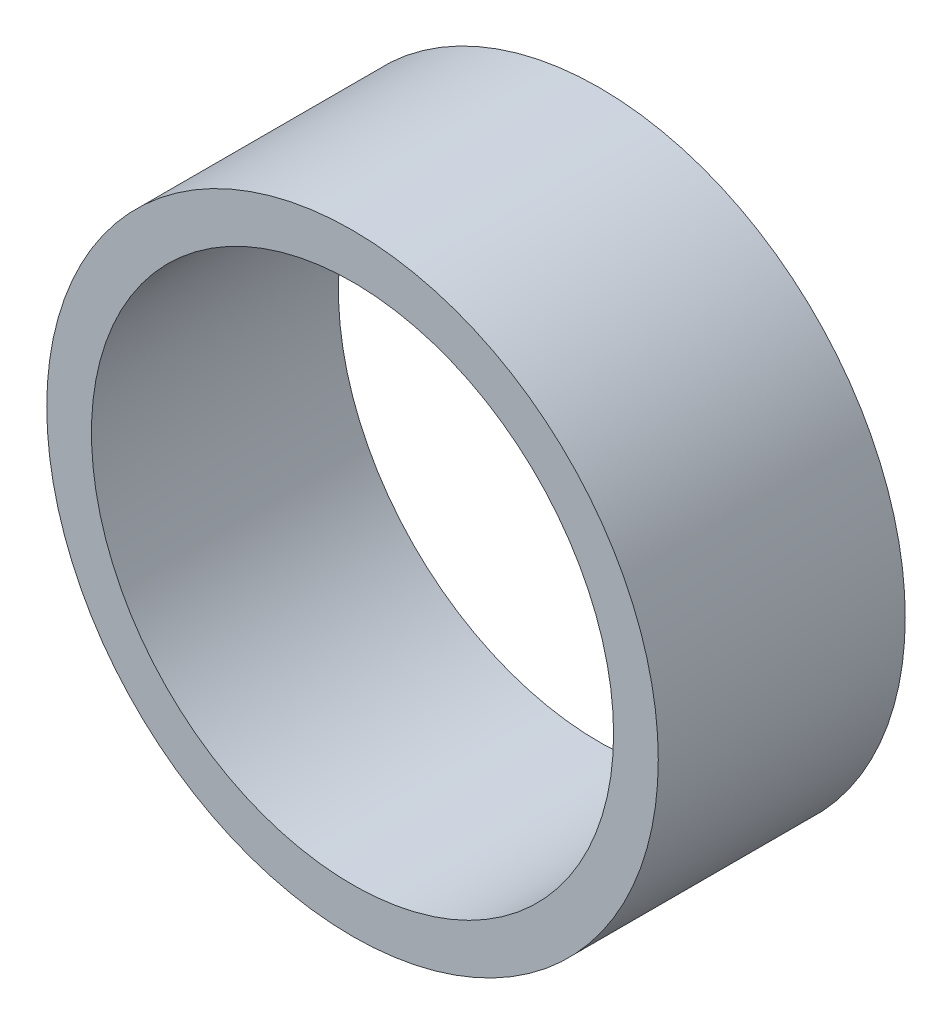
ISO-10303-21;
HEADER;
FILE_DESCRIPTION(('STEP AP214'),'2;1');
FILE_NAME('part.step','',(''),(''),'','','');
FILE_SCHEMA(('AUTOMOTIVE_DESIGN { 1 0 10303 214 1 1 1 1 }'));
ENDSEC;
DATA;
#1=APPLICATION_CONTEXT('core data for automotive mechanical design processes');
#2=APPLICATION_PROTOCOL_DEFINITION('international standard','automotive_design',2000,#1);
#3=PRODUCT_CONTEXT('',#1,'mechanical');
#4=PRODUCT('Part','Part','',(#3));
#5=PRODUCT_RELATED_PRODUCT_CATEGORY('part','',(#4));
#6=PRODUCT_DEFINITION_FORMATION('','',#4);
#7=PRODUCT_DEFINITION_CONTEXT('part definition',#1,'design');
#8=PRODUCT_DEFINITION('design','',#6,#7);
#9=PRODUCT_DEFINITION_SHAPE('','',#8);
#10=(LENGTH_UNIT() NAMED_UNIT(*) SI_UNIT(.MILLI.,.METRE.));
#11=(NAMED_UNIT(*) PLANE_ANGLE_UNIT() SI_UNIT($,.RADIAN.));
#12=(NAMED_UNIT(*) SI_UNIT($,.STERADIAN.) SOLID_ANGLE_UNIT());
#13=UNCERTAINTY_MEASURE_WITH_UNIT(LENGTH_MEASURE(1.E-05),#10,'distance_accuracy_value','');
#14=(GEOMETRIC_REPRESENTATION_CONTEXT(3) GLOBAL_UNCERTAINTY_ASSIGNED_CONTEXT((#13)) GLOBAL_UNIT_ASSIGNED_CONTEXT((#10,
#11,#12)) REPRESENTATION_CONTEXT('',''));
#15=CARTESIAN_POINT('',(0.,0.,0.));
#16=DIRECTION('',(0.,0.,1.));
#17=DIRECTION('',(1.,0.,0.));
#18=AXIS2_PLACEMENT_3D('',#15,#16,#17);
#19=CARTESIAN_POINT('',(0.,0.,-10.5));
#20=DIRECTION('',(0.,0.,1.));
#21=DIRECTION('',(1.,0.,0.));
#22=AXIS2_PLACEMENT_3D('',#19,#20,#21);
#23=CYLINDRICAL_SURFACE('',#22,13.);
#24=CARTESIAN_POINT('',(0.,0.,-10.5));
#25=DIRECTION('',(0.,0.,1.));
#26=DIRECTION('',(1.,0.,0.));
#27=AXIS2_PLACEMENT_3D('',#24,#25,#26);
#28=CIRCLE('',#27,13.);
#29=CARTESIAN_POINT('',(13.,0.,-10.5));
#30=VERTEX_POINT('',#29);
#31=EDGE_CURVE('E10',#30,#30,#28,.T.);
#32=CARTESIAN_POINT('',(0.,0.,0.));
#33=DIRECTION('',(0.,0.,1.));
#34=DIRECTION('',(1.,0.,0.));
#35=AXIS2_PLACEMENT_3D('',#32,#33,#34);
#36=CIRCLE('',#35,13.);
#37=CARTESIAN_POINT('',(13.,0.,0.));
#38=VERTEX_POINT('',#37);
#39=EDGE_CURVE('E35',#38,#38,#36,.T.);
#40=CARTESIAN_POINT('',(13.,0.,-10.5));
#41=CARTESIAN_POINT('',(13.,0.,-10.390625));
#42=CARTESIAN_POINT('',(13.,0.,-10.28125));
#43=CARTESIAN_POINT('',(13.,0.,-10.0625));
#44=CARTESIAN_POINT('',(13.,0.,-9.953125));
#45=CARTESIAN_POINT('',(13.,0.,-9.734375));
#46=CARTESIAN_POINT('',(13.,0.,-9.625));
#47=CARTESIAN_POINT('',(13.,0.,-9.40625));
#48=CARTESIAN_POINT('',(13.,0.,-9.296875));
#49=CARTESIAN_POINT('',(13.,0.,-9.078125));
#50=CARTESIAN_POINT('',(13.,0.,-8.96875));
#51=CARTESIAN_POINT('',(13.,0.,-8.75));
#52=CARTESIAN_POINT('',(13.,0.,-8.640625));
#53=CARTESIAN_POINT('',(13.,0.,-8.421875));
#54=CARTESIAN_POINT('',(13.,0.,-8.3125));
#55=CARTESIAN_POINT('',(13.,0.,-8.09375));
#56=CARTESIAN_POINT('',(13.,0.,-7.984375));
#57=CARTESIAN_POINT('',(13.,0.,-7.765625));
#58=CARTESIAN_POINT('',(13.,0.,-7.65625));
#59=CARTESIAN_POINT('',(13.,0.,-7.4375));
#60=CARTESIAN_POINT('',(13.,0.,-7.328125));
#61=CARTESIAN_POINT('',(13.,0.,-7.109375));
#62=CARTESIAN_POINT('',(13.,0.,-7.));
#63=CARTESIAN_POINT('',(13.,0.,-6.78125));
#64=CARTESIAN_POINT('',(13.,0.,-6.671875));
#65=CARTESIAN_POINT('',(13.,0.,-6.453125));
#66=CARTESIAN_POINT('',(13.,0.,-6.34375));
#67=CARTESIAN_POINT('',(13.,0.,-6.125));
#68=CARTESIAN_POINT('',(13.,0.,-6.015625));
#69=CARTESIAN_POINT('',(13.,0.,-5.796875));
#70=CARTESIAN_POINT('',(13.,0.,-5.6875));
#71=CARTESIAN_POINT('',(13.,0.,-5.46875));
#72=CARTESIAN_POINT('',(13.,0.,-5.359375));
#73=CARTESIAN_POINT('',(13.,0.,-5.140625));
#74=CARTESIAN_POINT('',(13.,0.,-5.03125));
#75=CARTESIAN_POINT('',(13.,0.,-4.8125));
#76=CARTESIAN_POINT('',(13.,0.,-4.703125));
#77=CARTESIAN_POINT('',(13.,0.,-4.484375));
#78=CARTESIAN_POINT('',(13.,0.,-4.375));
#79=CARTESIAN_POINT('',(13.,0.,-4.15625));
#80=CARTESIAN_POINT('',(13.,0.,-4.046875));
#81=CARTESIAN_POINT('',(13.,0.,-3.828125));
#82=CARTESIAN_POINT('',(13.,0.,-3.71875));
#83=CARTESIAN_POINT('',(13.,0.,-3.5));
#84=CARTESIAN_POINT('',(13.,0.,-3.390625));
#85=CARTESIAN_POINT('',(13.,0.,-3.171875));
#86=CARTESIAN_POINT('',(13.,0.,-3.0625));
#87=CARTESIAN_POINT('',(13.,0.,-2.84375));
#88=CARTESIAN_POINT('',(13.,0.,-2.734375));
#89=CARTESIAN_POINT('',(13.,0.,-2.515625));
#90=CARTESIAN_POINT('',(13.,0.,-2.40625));
#91=CARTESIAN_POINT('',(13.,0.,-2.1875));
#92=CARTESIAN_POINT('',(13.,0.,-2.078125));
#93=CARTESIAN_POINT('',(13.,0.,-1.859375));
#94=CARTESIAN_POINT('',(13.,0.,-1.75));
#95=CARTESIAN_POINT('',(13.,0.,-1.53125));
#96=CARTESIAN_POINT('',(13.,0.,-1.421875));
#97=CARTESIAN_POINT('',(13.,0.,-1.203125));
#98=CARTESIAN_POINT('',(13.,0.,-1.09375));
#99=CARTESIAN_POINT('',(13.,0.,-0.875000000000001));
#100=CARTESIAN_POINT('',(13.,0.,-0.765625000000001));
#101=CARTESIAN_POINT('',(13.,0.,-0.546875));
#102=CARTESIAN_POINT('',(13.,0.,-0.4375));
#103=CARTESIAN_POINT('',(13.,0.,-0.21875));
#104=CARTESIAN_POINT('',(13.,0.,-0.109375));
#105=CARTESIAN_POINT('',(13.,0.,0.));
#106=B_SPLINE_CURVE_WITH_KNOTS('',3,(#40,#41,#42,#43,#44,#45,#46,#47,#48,#49,#50,#51,#52,#53,
#54,#55,#56,#57,#58,#59,#60,#61,#62,#63,#64,#65,#66,#67,#68,#69,#70,#71,#72,#73,#74,#75,#76,#77,
#78,#79,#80,#81,#82,#83,#84,#85,#86,#87,#88,#89,#90,#91,#92,#93,#94,#95,#96,#97,#98,#99,#100,
#101,#102,#103,#104,#105),.UNSPECIFIED.,.F.,.F.,(4,2,2,2,2,2,2,2,2,2,2,2,2,2,2,2,2,2,2,2,2,2,2,
2,2,2,2,2,2,2,2,2,4),(0.,0.328125,0.656250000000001,0.984375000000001,1.3125,1.640625,1.96875,
2.296875,2.625,2.953125,3.28125,3.609375,3.9375,4.265625,4.59375,4.921875,5.25,5.578125,5.90625,
6.234375,6.5625,6.890625,7.21875,7.546875,7.875,8.203125,8.53125,8.859375,9.1875,9.515625,
9.84375,10.171875,10.5),.UNSPECIFIED.);
#107=EDGE_CURVE('BSEAM32',#30,#38,#106,.T.);
#108=ORIENTED_EDGE('',*,*,#31,.T.);
#109=ORIENTED_EDGE('',*,*,#39,.F.);
#110=ORIENTED_EDGE('',*,*,#107,.T.);
#111=ORIENTED_EDGE('',*,*,#107,.F.);
#112=EDGE_LOOP('',(#108,#110,#109,#111));
#113=FACE_BOUND('',#112,.T.);
#114=ADVANCED_FACE('F32',(#113),#23,.T.);
#115=CARTESIAN_POINT('',(0.,0.,-10.5));
#116=DIRECTION('',(0.,0.,1.));
#117=DIRECTION('',(1.,0.,0.));
#118=AXIS2_PLACEMENT_3D('',#115,#116,#117);
#119=PLANE('',#118);
#120=CARTESIAN_POINT('',(0.,0.,-10.5));
#121=DIRECTION('',(0.,0.,1.));
#122=DIRECTION('',(1.,0.,0.));
#123=AXIS2_PLACEMENT_3D('',#120,#121,#122);
#124=CIRCLE('',#123,11.1);
#125=CARTESIAN_POINT('',(11.1,0.,-10.5));
#126=VERTEX_POINT('',#125);
#127=EDGE_CURVE('E42',#126,#126,#124,.T.);
#128=ORIENTED_EDGE('',*,*,#127,.T.);
#129=EDGE_LOOP('',(#128));
#130=FACE_BOUND('',#129,.T.);
#131=ORIENTED_EDGE('',*,*,#31,.F.);
#132=EDGE_LOOP('',(#131));
#133=FACE_BOUND('',#132,.T.);
#134=ADVANCED_FACE('F50',(#130,#133),#119,.F.);
#135=CARTESIAN_POINT('',(0.,0.,0.));
#136=DIRECTION('',(0.,0.,1.));
#137=DIRECTION('',(1.,0.,0.));
#138=AXIS2_PLACEMENT_3D('',#135,#136,#137);
#139=PLANE('',#138);
#140=CARTESIAN_POINT('',(0.,0.,0.));
#141=DIRECTION('',(0.,0.,1.));
#142=DIRECTION('',(1.,0.,0.));
#143=AXIS2_PLACEMENT_3D('',#140,#141,#142);
#144=CIRCLE('',#143,11.1);
#145=CARTESIAN_POINT('',(11.1,0.,0.));
#146=VERTEX_POINT('',#145);
#147=EDGE_CURVE('E44',#146,#146,#144,.T.);
#148=ORIENTED_EDGE('',*,*,#147,.F.);
#149=EDGE_LOOP('',(#148));
#150=FACE_BOUND('',#149,.T.);
#151=ORIENTED_EDGE('',*,*,#39,.T.);
#152=EDGE_LOOP('',(#151));
#153=FACE_BOUND('',#152,.T.);
#154=ADVANCED_FACE('F56',(#150,#153),#139,.T.);
#155=CARTESIAN_POINT('',(0.,0.,-10.5));
#156=DIRECTION('',(0.,0.,1.));
#157=DIRECTION('',(1.,0.,0.));
#158=AXIS2_PLACEMENT_3D('',#155,#156,#157);
#159=CYLINDRICAL_SURFACE('',#158,11.1);
#160=CARTESIAN_POINT('',(11.1,0.,-10.5));
#161=CARTESIAN_POINT('',(11.1,0.,-10.390625));
#162=CARTESIAN_POINT('',(11.1,0.,-10.28125));
#163=CARTESIAN_POINT('',(11.1,0.,-10.0625));
#164=CARTESIAN_POINT('',(11.1,0.,-9.953125));
#165=CARTESIAN_POINT('',(11.1,0.,-9.734375));
#166=CARTESIAN_POINT('',(11.1,0.,-9.625));
#167=CARTESIAN_POINT('',(11.1,0.,-9.40625));
#168=CARTESIAN_POINT('',(11.1,0.,-9.296875));
#169=CARTESIAN_POINT('',(11.1,0.,-9.078125));
#170=CARTESIAN_POINT('',(11.1,0.,-8.96875));
#171=CARTESIAN_POINT('',(11.1,0.,-8.75));
#172=CARTESIAN_POINT('',(11.1,0.,-8.640625));
#173=CARTESIAN_POINT('',(11.1,0.,-8.421875));
#174=CARTESIAN_POINT('',(11.1,0.,-8.3125));
#175=CARTESIAN_POINT('',(11.1,0.,-8.09375));
#176=CARTESIAN_POINT('',(11.1,0.,-7.984375));
#177=CARTESIAN_POINT('',(11.1,0.,-7.765625));
#178=CARTESIAN_POINT('',(11.1,0.,-7.65625));
#179=CARTESIAN_POINT('',(11.1,0.,-7.4375));
#180=CARTESIAN_POINT('',(11.1,0.,-7.328125));
#181=CARTESIAN_POINT('',(11.1,0.,-7.109375));
#182=CARTESIAN_POINT('',(11.1,0.,-7.));
#183=CARTESIAN_POINT('',(11.1,0.,-6.78125));
#184=CARTESIAN_POINT('',(11.1,0.,-6.671875));
#185=CARTESIAN_POINT('',(11.1,0.,-6.453125));
#186=CARTESIAN_POINT('',(11.1,0.,-6.34375));
#187=CARTESIAN_POINT('',(11.1,0.,-6.125));
#188=CARTESIAN_POINT('',(11.1,0.,-6.015625));
#189=CARTESIAN_POINT('',(11.1,0.,-5.796875));
#190=CARTESIAN_POINT('',(11.1,0.,-5.6875));
#191=CARTESIAN_POINT('',(11.1,0.,-5.46875));
#192=CARTESIAN_POINT('',(11.1,0.,-5.359375));
#193=CARTESIAN_POINT('',(11.1,0.,-5.140625));
#194=CARTESIAN_POINT('',(11.1,0.,-5.03125));
#195=CARTESIAN_POINT('',(11.1,0.,-4.8125));
#196=CARTESIAN_POINT('',(11.1,0.,-4.703125));
#197=CARTESIAN_POINT('',(11.1,0.,-4.484375));
#198=CARTESIAN_POINT('',(11.1,0.,-4.375));
#199=CARTESIAN_POINT('',(11.1,0.,-4.15625));
#200=CARTESIAN_POINT('',(11.1,0.,-4.046875));
#201=CARTESIAN_POINT('',(11.1,0.,-3.828125));
#202=CARTESIAN_POINT('',(11.1,0.,-3.71875));
#203=CARTESIAN_POINT('',(11.1,0.,-3.5));
#204=CARTESIAN_POINT('',(11.1,0.,-3.390625));
#205=CARTESIAN_POINT('',(11.1,0.,-3.171875));
#206=CARTESIAN_POINT('',(11.1,0.,-3.0625));
#207=CARTESIAN_POINT('',(11.1,0.,-2.84375));
#208=CARTESIAN_POINT('',(11.1,0.,-2.734375));
#209=CARTESIAN_POINT('',(11.1,0.,-2.515625));
#210=CARTESIAN_POINT('',(11.1,0.,-2.40625));
#211=CARTESIAN_POINT('',(11.1,0.,-2.1875));
#212=CARTESIAN_POINT('',(11.1,0.,-2.078125));
#213=CARTESIAN_POINT('',(11.1,0.,-1.859375));
#214=CARTESIAN_POINT('',(11.1,0.,-1.75));
#215=CARTESIAN_POINT('',(11.1,0.,-1.53125));
#216=CARTESIAN_POINT('',(11.1,0.,-1.421875));
#217=CARTESIAN_POINT('',(11.1,0.,-1.203125));
#218=CARTESIAN_POINT('',(11.1,0.,-1.09375));
#219=CARTESIAN_POINT('',(11.1,0.,-0.875000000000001));
#220=CARTESIAN_POINT('',(11.1,0.,-0.765625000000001));
#221=CARTESIAN_POINT('',(11.1,0.,-0.546875));
#222=CARTESIAN_POINT('',(11.1,0.,-0.4375));
#223=CARTESIAN_POINT('',(11.1,0.,-0.21875));
#224=CARTESIAN_POINT('',(11.1,0.,-0.109375));
#225=CARTESIAN_POINT('',(11.1,0.,0.));
#226=B_SPLINE_CURVE_WITH_KNOTS('',3,(#160,#161,#162,#163,#164,#165,#166,#167,#168,#169,#170,
#171,#172,#173,#174,#175,#176,#177,#178,#179,#180,#181,#182,#183,#184,#185,#186,#187,#188,#189,
#190,#191,#192,#193,#194,#195,#196,#197,#198,#199,#200,#201,#202,#203,#204,#205,#206,#207,#208,
#209,#210,#211,#212,#213,#214,#215,#216,#217,#218,#219,#220,#221,#222,#223,#224,#225),
.UNSPECIFIED.,.F.,.F.,(4,2,2,2,2,2,2,2,2,2,2,2,2,2,2,2,2,2,2,2,2,2,2,2,2,2,2,2,2,2,2,2,4),(0.,
0.328124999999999,0.656249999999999,0.984374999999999,1.3125,1.640625,1.96875,2.296875,2.625,
2.953125,3.28125,3.609375,3.9375,4.265625,4.59375,4.921875,5.25,5.578125,5.90625,6.234375,
6.5625,6.890625,7.21875,7.546875,7.875,8.203125,8.53125,8.859375,9.1875,9.515625,9.84375,
10.171875,10.5),.UNSPECIFIED.);
#227=EDGE_CURVE('BSEAM53',#126,#146,#226,.T.);
#228=ORIENTED_EDGE('',*,*,#127,.F.);
#229=ORIENTED_EDGE('',*,*,#147,.T.);
#230=ORIENTED_EDGE('',*,*,#227,.T.);
#231=ORIENTED_EDGE('',*,*,#227,.F.);
#232=EDGE_LOOP('',(#228,#230,#229,#231));
#233=FACE_BOUND('',#232,.T.);
#234=ADVANCED_FACE('F53',(#233),#159,.F.);
#235=CLOSED_SHELL('',(#114,#134,#154,#234));
#236=MANIFOLD_SOLID_BREP('B2',#235);
#237=ADVANCED_BREP_SHAPE_REPRESENTATION('',(#18,#236),#14);
#238=SHAPE_DEFINITION_REPRESENTATION(#9,#237);
ENDSEC;
END-ISO-10303-21;
